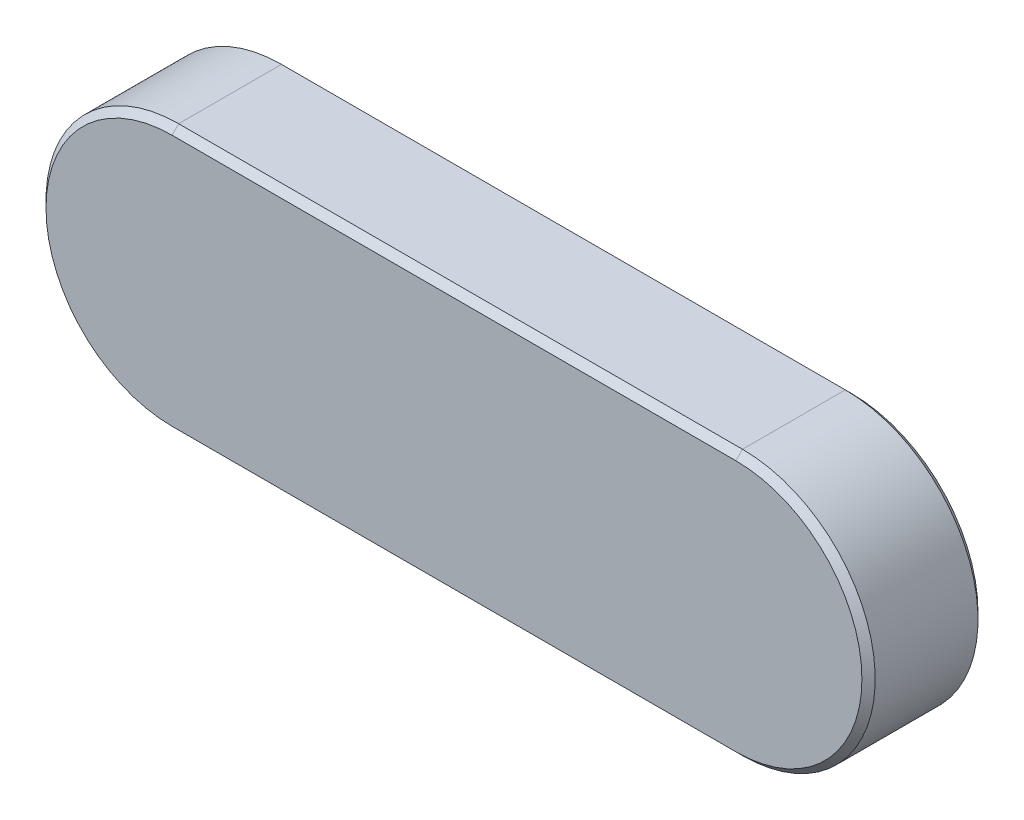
from build123d import *

# Parameters (mm, degrees)
BASEKEY_DEPTH = 3.5
CHAMFER1_SIZE = 0.4


with BuildPart() as part:
    # Sketch1 → BaseKey (new, symmetric)
    with BuildSketch(Plane.XY):
        with BuildLine():
            Line((-17, 8), (17, 8))
            ThreePointArc((17, 8), (25, 0), (17, -8))
            Line((17, -8), (-17, -8))
            ThreePointArc((-17, -8), (-25, 0), (-17, 8))
        make_face()
    extrude(amount=BASEKEY_DEPTH, both=True)

    # Chamfer1
    chamfer1_edges = [part.edges().sort_by_distance(p)[0] for p in [
        (25, 0, 3.5),
        (0, 8, 3.5),
        (-25, 0, 3.5),
        (0, 8, -3.5),
        (25, 0, -3.5),
        (0, -8, -3.5),
        (-25, 0, -3.5),
        (0, -8, 3.5),
    ]]
    chamfer(chamfer1_edges, length=CHAMFER1_SIZE)


solid = part.part
